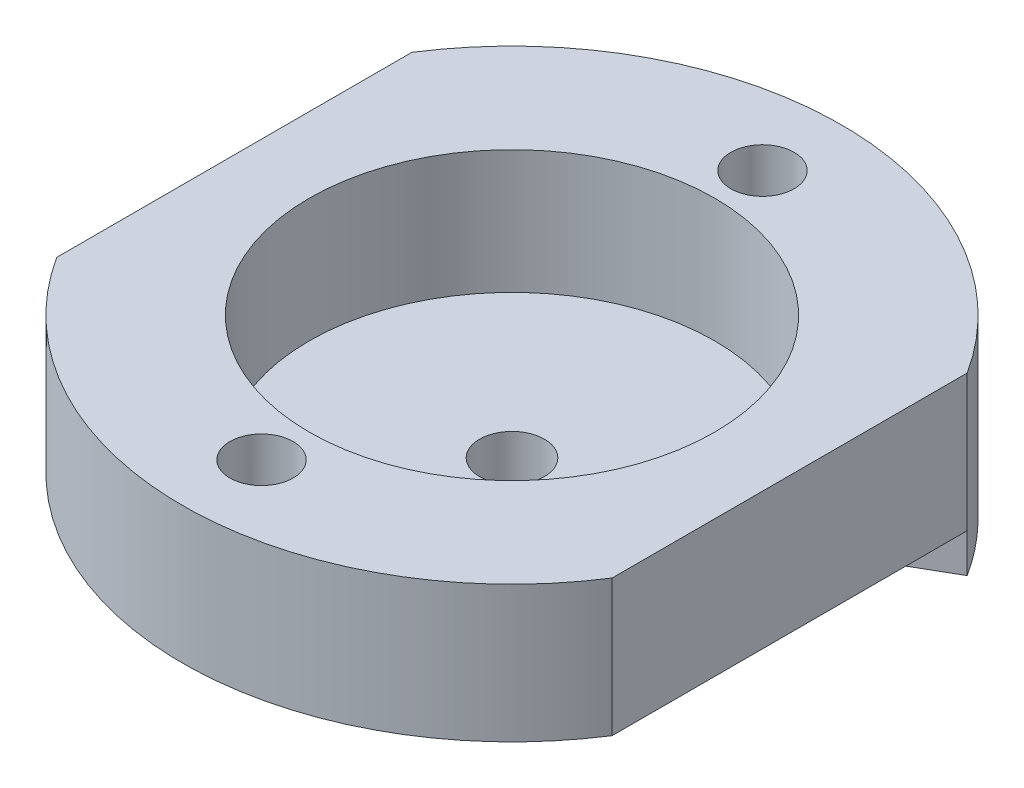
ISO-10303-21;
HEADER;
FILE_DESCRIPTION(('STEP AP214'),'2;1');
FILE_NAME('part.step','',(''),(''),'','','');
FILE_SCHEMA(('AUTOMOTIVE_DESIGN { 1 0 10303 214 1 1 1 1 }'));
ENDSEC;
DATA;
#1=APPLICATION_CONTEXT('core data for automotive mechanical design processes');
#2=APPLICATION_PROTOCOL_DEFINITION('international standard','automotive_design',2000,#1);
#3=PRODUCT_CONTEXT('',#1,'mechanical');
#4=PRODUCT('Part','Part','',(#3));
#5=PRODUCT_RELATED_PRODUCT_CATEGORY('part','',(#4));
#6=PRODUCT_DEFINITION_FORMATION('','',#4);
#7=PRODUCT_DEFINITION_CONTEXT('part definition',#1,'design');
#8=PRODUCT_DEFINITION('design','',#6,#7);
#9=PRODUCT_DEFINITION_SHAPE('','',#8);
#10=(LENGTH_UNIT() NAMED_UNIT(*) SI_UNIT(.MILLI.,.METRE.));
#11=(NAMED_UNIT(*) PLANE_ANGLE_UNIT() SI_UNIT($,.RADIAN.));
#12=(NAMED_UNIT(*) SI_UNIT($,.STERADIAN.) SOLID_ANGLE_UNIT());
#13=UNCERTAINTY_MEASURE_WITH_UNIT(LENGTH_MEASURE(1.E-05),#10,'distance_accuracy_value','');
#14=(GEOMETRIC_REPRESENTATION_CONTEXT(3) GLOBAL_UNCERTAINTY_ASSIGNED_CONTEXT((#13)) GLOBAL_UNIT_ASSIGNED_CONTEXT((#10,
#11,#12)) REPRESENTATION_CONTEXT('',''));
#15=CARTESIAN_POINT('',(0.,0.,0.));
#16=DIRECTION('',(0.,0.,1.));
#17=DIRECTION('',(1.,0.,0.));
#18=AXIS2_PLACEMENT_3D('',#15,#16,#17);
#19=CARTESIAN_POINT('',(0.,-20.3794311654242,0.));
#20=DIRECTION('',(0.,1.,0.));
#21=DIRECTION('',(0.,0.,1.));
#22=AXIS2_PLACEMENT_3D('',#19,#20,#21);
#23=CYLINDRICAL_SURFACE('',#22,5.588);
#24=CARTESIAN_POINT('',(0.,-0.5,0.));
#25=DIRECTION('',(0.,1.,0.));
#26=DIRECTION('',(0.,0.,1.));
#27=AXIS2_PLACEMENT_3D('',#24,#25,#26);
#28=CIRCLE('',#27,5.588);
#29=CARTESIAN_POINT('',(-5.37616666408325,-0.5,1.524));
#30=VERTEX_POINT('',#29);
#31=CARTESIAN_POINT('',(4.32985933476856,-0.5,-3.53243006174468));
#32=VERTEX_POINT('',#31);
#33=EDGE_CURVE('E228',#30,#32,#28,.T.);
#34=ORIENTED_EDGE('',*,*,#33,.T.);
#35=DIRECTION('',(0.,-1.,0.));
#36=VECTOR('',#35,1.);
#37=CARTESIAN_POINT('',(4.32985933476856,8.23960183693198,-3.53243006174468));
#38=LINE('',#37,#36);
#39=CARTESIAN_POINT('',(4.32985933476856,-2.,-3.53243006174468));
#40=VERTEX_POINT('',#39);
#41=EDGE_CURVE('E462',#32,#40,#38,.T.);
#42=ORIENTED_EDGE('',*,*,#41,.T.);
#43=CARTESIAN_POINT('',(0.,-2.,0.));
#44=DIRECTION('',(0.,-1.,0.));
#45=DIRECTION('',(0.,0.,-1.));
#46=AXIS2_PLACEMENT_3D('',#43,#44,#45);
#47=CIRCLE('',#46,5.588);
#48=CARTESIAN_POINT('',(-5.37616666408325,-2.,1.524));
#49=VERTEX_POINT('',#48);
#50=EDGE_CURVE('E239',#49,#40,#47,.F.);
#51=ORIENTED_EDGE('',*,*,#50,.F.);
#52=DIRECTION('',(0.,1.,0.));
#53=VECTOR('',#52,1.);
#54=CARTESIAN_POINT('',(-5.37616666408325,-20.3794311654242,1.524));
#55=LINE('',#54,#53);
#56=EDGE_CURVE('E197',#49,#30,#55,.T.);
#57=ORIENTED_EDGE('',*,*,#56,.T.);
#58=EDGE_LOOP('',(#34,#42,#51,#57));
#59=FACE_BOUND('',#58,.T.);
#60=ADVANCED_FACE('F32',(#59),#23,.F.);
#61=CARTESIAN_POINT('',(0.,-2.,0.));
#62=DIRECTION('',(0.,-1.,0.));
#63=DIRECTION('',(0.,0.,-1.));
#64=AXIS2_PLACEMENT_3D('',#61,#62,#63);
#65=PLANE('',#64);
#66=DIRECTION('',(-0.676367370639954,0.,0.736564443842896));
#67=VECTOR('',#66,1.);
#68=CARTESIAN_POINT('',(4.32985933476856,-2.,-3.53243006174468));
#69=LINE('',#68,#67);
#70=CARTESIAN_POINT('',(9.16205789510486,-2.,-8.79469698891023));
#71=VERTEX_POINT('',#70);
#72=EDGE_CURVE('E178',#71,#40,#69,.T.);
#73=ORIENTED_EDGE('',*,*,#72,.F.);
#74=CARTESIAN_POINT('',(0.,-2.,0.));
#75=DIRECTION('',(0.,-1.,0.));
#76=DIRECTION('',(0.,0.,-1.));
#77=AXIS2_PLACEMENT_3D('',#74,#75,#76);
#78=CIRCLE('',#77,12.7);
#79=CARTESIAN_POINT('',(10.7,-2.,-6.84105255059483));
#80=VERTEX_POINT('',#79);
#81=EDGE_CURVE('E195',#71,#80,#78,.T.);
#82=ORIENTED_EDGE('',*,*,#81,.T.);
#83=DIRECTION('',(-0.866025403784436,0.,0.500000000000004));
#84=VECTOR('',#83,1.);
#85=CARTESIAN_POINT('',(10.7,-2.,-6.84105255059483));
#86=LINE('',#85,#84);
#87=CARTESIAN_POINT('',(5.6310617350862,-2.,-3.91449967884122));
#88=VERTEX_POINT('',#87);
#89=EDGE_CURVE('E56',#80,#88,#86,.T.);
#90=ORIENTED_EDGE('',*,*,#89,.T.);
#91=CARTESIAN_POINT('',(0.,-2.,0.));
#92=DIRECTION('',(0.,-1.,0.));
#93=DIRECTION('',(0.,0.,-1.));
#94=AXIS2_PLACEMENT_3D('',#91,#92,#93);
#95=CIRCLE('',#94,6.858);
#96=CARTESIAN_POINT('',(-5.37616666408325,-2.,4.25781587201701));
#97=VERTEX_POINT('',#96);
#98=EDGE_CURVE('E235',#88,#97,#95,.T.);
#99=ORIENTED_EDGE('',*,*,#98,.T.);
#100=DIRECTION('',(0.,0.,-1.));
#101=VECTOR('',#100,1.);
#102=CARTESIAN_POINT('',(-5.37616666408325,-2.,1.524));
#103=LINE('',#102,#101);
#104=EDGE_CURVE('E217',#97,#49,#103,.T.);
#105=ORIENTED_EDGE('',*,*,#104,.T.);
#106=ORIENTED_EDGE('',*,*,#50,.T.);
#107=EDGE_LOOP('',(#73,#82,#90,#99,#105,#106));
#108=FACE_BOUND('',#107,.T.);
#109=ADVANCED_FACE('F390',(#108),#65,.T.);
#110=CARTESIAN_POINT('',(0.,-0.5,0.));
#111=DIRECTION('',(0.,-1.,0.));
#112=DIRECTION('',(0.,0.,-1.));
#113=AXIS2_PLACEMENT_3D('',#110,#111,#112);
#114=PLANE('',#113);
#115=DIRECTION('',(1.,0.,0.));
#116=VECTOR('',#115,1.);
#117=CARTESIAN_POINT('',(-10.7,-0.5,-1.524));
#118=LINE('',#117,#116);
#119=CARTESIAN_POINT('',(-4.35,-0.5,-1.524));
#120=VERTEX_POINT('',#119);
#121=CARTESIAN_POINT('',(-1.65527157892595,-0.5,-1.524));
#122=VERTEX_POINT('',#121);
#123=EDGE_CURVE('E258',#120,#122,#118,.T.);
#124=ORIENTED_EDGE('',*,*,#123,.F.);
#125=DIRECTION('',(0.,0.,-1.));
#126=VECTOR('',#125,1.);
#127=CARTESIAN_POINT('',(-4.35,-0.5,1.675));
#128=LINE('',#127,#126);
#129=CARTESIAN_POINT('',(-4.35,-0.5,1.524));
#130=VERTEX_POINT('',#129);
#131=EDGE_CURVE('E251',#130,#120,#128,.T.);
#132=ORIENTED_EDGE('',*,*,#131,.F.);
#133=DIRECTION('',(-1.,0.,0.));
#134=VECTOR('',#133,1.);
#135=CARTESIAN_POINT('',(-10.7,-0.5,1.524));
#136=LINE('',#135,#134);
#137=CARTESIAN_POINT('',(-1.65527157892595,-0.5,1.524));
#138=VERTEX_POINT('',#137);
#139=EDGE_CURVE('E257',#138,#130,#136,.T.);
#140=ORIENTED_EDGE('',*,*,#139,.F.);
#141=CARTESIAN_POINT('',(0.,-0.5,0.));
#142=DIRECTION('',(0.,-1.,0.));
#143=DIRECTION('',(0.,0.,-1.));
#144=AXIS2_PLACEMENT_3D('',#141,#142,#143);
#145=CIRCLE('',#144,2.25);
#146=EDGE_CURVE('E296',#122,#138,#145,.T.);
#147=ORIENTED_EDGE('',*,*,#146,.F.);
#148=EDGE_LOOP('',(#124,#132,#140,#147));
#149=FACE_BOUND('',#148,.T.);
#150=CARTESIAN_POINT('',(0.,-0.5,9.652));
#151=DIRECTION('',(0.,-1.,0.));
#152=DIRECTION('',(0.,0.,-1.));
#153=AXIS2_PLACEMENT_3D('',#150,#151,#152);
#154=CIRCLE('',#153,1.2192);
#155=CARTESIAN_POINT('',(0.,-0.5,8.4328));
#156=VERTEX_POINT('',#155);
#157=EDGE_CURVE('E290',#156,#156,#154,.T.);
#158=ORIENTED_EDGE('',*,*,#157,.F.);
#159=EDGE_LOOP('',(#158));
#160=FACE_BOUND('',#159,.T.);
#161=CARTESIAN_POINT('',(0.,-0.5,-9.652));
#162=DIRECTION('',(0.,-1.,0.));
#163=DIRECTION('',(0.,0.,-1.));
#164=AXIS2_PLACEMENT_3D('',#161,#162,#163);
#165=CIRCLE('',#164,1.2192);
#166=CARTESIAN_POINT('',(0.,-0.5,-10.8712));
#167=VERTEX_POINT('',#166);
#168=EDGE_CURVE('E284',#167,#167,#165,.T.);
#169=ORIENTED_EDGE('',*,*,#168,.F.);
#170=EDGE_LOOP('',(#169));
#171=FACE_BOUND('',#170,.T.);
#172=CARTESIAN_POINT('',(0.,-0.5,0.));
#173=DIRECTION('',(0.,-1.,0.));
#174=DIRECTION('',(0.,0.,1.));
#175=AXIS2_PLACEMENT_3D('',#172,#173,#174);
#176=CIRCLE('',#175,6.858);
#177=CARTESIAN_POINT('',(5.6310617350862,-0.5,-3.91449967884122));
#178=VERTEX_POINT('',#177);
#179=CARTESIAN_POINT('',(-5.37616666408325,-0.5,4.25781587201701));
#180=VERTEX_POINT('',#179);
#181=EDGE_CURVE('E222',#178,#180,#176,.T.);
#182=ORIENTED_EDGE('',*,*,#181,.F.);
#183=DIRECTION('',(-0.866025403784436,0.,0.500000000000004));
#184=VECTOR('',#183,1.);
#185=CARTESIAN_POINT('',(10.7,-0.5,-6.84105255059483));
#186=LINE('',#185,#184);
#187=CARTESIAN_POINT('',(10.7,-0.5,-6.84105255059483));
#188=VERTEX_POINT('',#187);
#189=EDGE_CURVE('E205',#188,#178,#186,.T.);
#190=ORIENTED_EDGE('',*,*,#189,.F.);
#191=DIRECTION('',(0.,0.,-1.));
#192=VECTOR('',#191,1.);
#193=CARTESIAN_POINT('',(10.7,-0.5,0.));
#194=LINE('',#193,#192);
#195=CARTESIAN_POINT('',(10.7,-0.5,6.84105255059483));
#196=VERTEX_POINT('',#195);
#197=EDGE_CURVE('E273',#196,#188,#194,.T.);
#198=ORIENTED_EDGE('',*,*,#197,.F.);
#199=CARTESIAN_POINT('',(0.,-0.5,0.));
#200=DIRECTION('',(0.,-1.,0.));
#201=DIRECTION('',(0.,0.,-1.));
#202=AXIS2_PLACEMENT_3D('',#199,#200,#201);
#203=CIRCLE('',#202,12.7);
#204=CARTESIAN_POINT('',(-10.7,-0.5,6.84105255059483));
#205=VERTEX_POINT('',#204);
#206=EDGE_CURVE('E302',#196,#205,#203,.T.);
#207=ORIENTED_EDGE('',*,*,#206,.T.);
#208=DIRECTION('',(0.,0.,1.));
#209=VECTOR('',#208,1.);
#210=CARTESIAN_POINT('',(-10.7,-0.5,0.));
#211=LINE('',#210,#209);
#212=CARTESIAN_POINT('',(-10.7,-0.5,-6.84105255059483));
#213=VERTEX_POINT('',#212);
#214=EDGE_CURVE('E279',#213,#205,#211,.T.);
#215=ORIENTED_EDGE('',*,*,#214,.F.);
#216=CARTESIAN_POINT('',(5.90618106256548,-0.5,-11.2430878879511));
#217=VERTEX_POINT('',#216);
#218=EDGE_CURVE('E303',#213,#217,#203,.T.);
#219=ORIENTED_EDGE('',*,*,#218,.T.);
#220=DIRECTION('',(0.424528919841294,0.,-0.905414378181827));
#221=VECTOR('',#220,1.);
#222=CARTESIAN_POINT('',(3.42136840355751,-0.5,-5.94360179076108));
#223=LINE('',#222,#221);
#224=CARTESIAN_POINT('',(3.42136840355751,-0.5,-5.94360179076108));
#225=VERTEX_POINT('',#224);
#226=EDGE_CURVE('E202',#225,#217,#223,.T.);
#227=ORIENTED_EDGE('',*,*,#226,.F.);
#228=CARTESIAN_POINT('',(-5.37616666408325,-0.5,-4.25781587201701));
#229=VERTEX_POINT('',#228);
#230=EDGE_CURVE('E219',#229,#225,#176,.T.);
#231=ORIENTED_EDGE('',*,*,#230,.F.);
#232=DIRECTION('',(0.,0.,-1.));
#233=VECTOR('',#232,1.);
#234=CARTESIAN_POINT('',(-5.37616666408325,-0.5,-1.524));
#235=LINE('',#234,#233);
#236=CARTESIAN_POINT('',(-5.37616666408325,-0.5,-1.524));
#237=VERTEX_POINT('',#236);
#238=EDGE_CURVE('E223',#237,#229,#235,.T.);
#239=ORIENTED_EDGE('',*,*,#238,.F.);
#240=CARTESIAN_POINT('',(3.15135622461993,-0.5,-4.61461785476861));
#241=VERTEX_POINT('',#240);
#242=EDGE_CURVE('E231',#241,#237,#28,.T.);
#243=ORIENTED_EDGE('',*,*,#242,.F.);
#244=DIRECTION('',(-0.676367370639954,0.,0.736564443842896));
#245=VECTOR('',#244,1.);
#246=CARTESIAN_POINT('',(3.15135622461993,-0.5,-4.61461785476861));
#247=LINE('',#246,#245);
#248=CARTESIAN_POINT('',(7.98355478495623,-0.5,-9.87688478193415));
#249=VERTEX_POINT('',#248);
#250=EDGE_CURVE('E213',#249,#241,#247,.T.);
#251=ORIENTED_EDGE('',*,*,#250,.F.);
#252=CARTESIAN_POINT('',(0.,-0.5,0.));
#253=DIRECTION('',(0.,-1.,0.));
#254=DIRECTION('',(0.,0.,-1.));
#255=AXIS2_PLACEMENT_3D('',#252,#253,#254);
#256=CIRCLE('',#255,12.7);
#257=CARTESIAN_POINT('',(9.16205789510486,-0.5,-8.79469698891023));
#258=VERTEX_POINT('',#257);
#259=EDGE_CURVE('E189',#258,#249,#256,.F.);
#260=ORIENTED_EDGE('',*,*,#259,.F.);
#261=DIRECTION('',(0.676367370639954,0.,-0.736564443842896));
#262=VECTOR('',#261,1.);
#263=CARTESIAN_POINT('',(4.32985933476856,-0.5,-3.53243006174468));
#264=LINE('',#263,#262);
#265=EDGE_CURVE('E465',#32,#258,#264,.T.);
#266=ORIENTED_EDGE('',*,*,#265,.F.);
#267=ORIENTED_EDGE('',*,*,#33,.F.);
#268=DIRECTION('',(0.,0.,-1.));
#269=VECTOR('',#268,1.);
#270=CARTESIAN_POINT('',(-5.37616666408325,-0.5,1.524));
#271=LINE('',#270,#269);
#272=EDGE_CURVE('E214',#180,#30,#271,.T.);
#273=ORIENTED_EDGE('',*,*,#272,.F.);
#274=EDGE_LOOP('',(#182,#190,#198,#207,#215,#219,#227,#231,#239,#243,#251,#260,#266,#267,#273));
#275=FACE_BOUND('',#274,.T.);
#276=ADVANCED_FACE('F386',(#149,#160,#171,#275),#114,.T.);
#277=CARTESIAN_POINT('',(0.,-20.3794311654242,0.));
#278=DIRECTION('',(0.,1.,0.));
#279=DIRECTION('',(0.,0.,1.));
#280=AXIS2_PLACEMENT_3D('',#277,#278,#279);
#281=CYLINDRICAL_SURFACE('',#280,6.858);
#282=DIRECTION('',(0.,1.,0.));
#283=VECTOR('',#282,1.);
#284=CARTESIAN_POINT('',(5.6310617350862,-12.3289245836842,-3.91449967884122));
#285=LINE('',#284,#283);
#286=EDGE_CURVE('E207',#88,#178,#285,.T.);
#287=ORIENTED_EDGE('',*,*,#286,.T.);
#288=ORIENTED_EDGE('',*,*,#181,.T.);
#289=DIRECTION('',(0.,1.,0.));
#290=VECTOR('',#289,1.);
#291=CARTESIAN_POINT('',(-5.37616666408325,-20.3794311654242,4.25781587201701));
#292=LINE('',#291,#290);
#293=EDGE_CURVE('E218',#97,#180,#292,.T.);
#294=ORIENTED_EDGE('',*,*,#293,.F.);
#295=ORIENTED_EDGE('',*,*,#98,.F.);
#296=EDGE_LOOP('',(#287,#288,#294,#295));
#297=FACE_BOUND('',#296,.T.);
#298=ADVANCED_FACE('F389',(#297),#281,.T.);
#299=DIRECTION('',(0.,1.,0.));
#300=VECTOR('',#299,1.);
#301=CARTESIAN_POINT('',(3.42136840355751,-12.3289245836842,-5.94360179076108));
#302=LINE('',#301,#300);
#303=CARTESIAN_POINT('',(3.42136840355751,-2.,-5.94360179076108));
#304=VERTEX_POINT('',#303);
#305=EDGE_CURVE('E210',#304,#225,#302,.T.);
#306=ORIENTED_EDGE('',*,*,#305,.F.);
#307=CARTESIAN_POINT('',(-5.37616666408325,-2.,-4.25781587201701));
#308=VERTEX_POINT('',#307);
#309=EDGE_CURVE('E232',#308,#304,#95,.T.);
#310=ORIENTED_EDGE('',*,*,#309,.F.);
#311=DIRECTION('',(0.,1.,0.));
#312=VECTOR('',#311,1.);
#313=CARTESIAN_POINT('',(-5.37616666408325,-20.3794311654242,-4.25781587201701));
#314=LINE('',#313,#312);
#315=EDGE_CURVE('E226',#308,#229,#314,.T.);
#316=ORIENTED_EDGE('',*,*,#315,.T.);
#317=ORIENTED_EDGE('',*,*,#230,.T.);
#318=EDGE_LOOP('',(#306,#310,#316,#317));
#319=FACE_BOUND('',#318,.T.);
#320=ADVANCED_FACE('F365',(#319),#281,.T.);
#321=CARTESIAN_POINT('',(-10.7,-2.,-6.84105255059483));
#322=DIRECTION('',(1.,0.,0.));
#323=DIRECTION('',(0.,0.,-1.));
#324=AXIS2_PLACEMENT_3D('',#321,#322,#323);
#325=PLANE('',#324);
#326=ORIENTED_EDGE('',*,*,#214,.T.);
#327=DIRECTION('',(0.,-1.,0.));
#328=VECTOR('',#327,1.);
#329=CARTESIAN_POINT('',(-10.7,4.762500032,6.84105255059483));
#330=LINE('',#329,#328);
#331=CARTESIAN_POINT('',(-10.7,4.762500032,6.84105255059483));
#332=VERTEX_POINT('',#331);
#333=EDGE_CURVE('E325',#332,#205,#330,.T.);
#334=ORIENTED_EDGE('',*,*,#333,.F.);
#335=DIRECTION('',(0.,0.,-1.));
#336=VECTOR('',#335,1.);
#337=CARTESIAN_POINT('',(-10.7,4.762500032,-6.84105255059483));
#338=LINE('',#337,#336);
#339=CARTESIAN_POINT('',(-10.7,4.762500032,-6.84105255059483));
#340=VERTEX_POINT('',#339);
#341=EDGE_CURVE('E276',#332,#340,#338,.T.);
#342=ORIENTED_EDGE('',*,*,#341,.T.);
#343=DIRECTION('',(0.,-1.,0.));
#344=VECTOR('',#343,1.);
#345=CARTESIAN_POINT('',(-10.7,4.762500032,-6.84105255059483));
#346=LINE('',#345,#344);
#347=EDGE_CURVE('E322',#213,#340,#346,.F.);
#348=ORIENTED_EDGE('',*,*,#347,.F.);
#349=EDGE_LOOP('',(#326,#334,#342,#348));
#350=FACE_BOUND('',#349,.T.);
#351=ADVANCED_FACE('F361',(#350),#325,.F.);
#352=CARTESIAN_POINT('',(0.,-2.,0.));
#353=DIRECTION('',(0.,1.,0.));
#354=DIRECTION('',(0.,0.,1.));
#355=AXIS2_PLACEMENT_3D('',#352,#353,#354);
#356=CYLINDRICAL_SURFACE('',#355,2.25);
#357=DIRECTION('',(0.,1.,0.));
#358=VECTOR('',#357,1.);
#359=CARTESIAN_POINT('',(-1.65527157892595,-2.,1.524));
#360=LINE('',#359,#358);
#361=CARTESIAN_POINT('',(-1.65527157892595,-1.5,1.524));
#362=VERTEX_POINT('',#361);
#363=EDGE_CURVE('E269',#362,#138,#360,.T.);
#364=ORIENTED_EDGE('',*,*,#363,.F.);
#365=CARTESIAN_POINT('',(0.,-1.5,0.));
#366=DIRECTION('',(0.,-1.,0.));
#367=DIRECTION('',(0.,0.,-1.));
#368=AXIS2_PLACEMENT_3D('',#365,#366,#367);
#369=CIRCLE('',#368,2.25);
#370=CARTESIAN_POINT('',(-1.65527157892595,-1.5,-1.524));
#371=VERTEX_POINT('',#370);
#372=EDGE_CURVE('E319',#362,#371,#369,.F.);
#373=ORIENTED_EDGE('',*,*,#372,.T.);
#374=DIRECTION('',(0.,1.,0.));
#375=VECTOR('',#374,1.);
#376=CARTESIAN_POINT('',(-1.65527157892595,-2.,-1.524));
#377=LINE('',#376,#375);
#378=EDGE_CURVE('E266',#122,#371,#377,.F.);
#379=ORIENTED_EDGE('',*,*,#378,.F.);
#380=ORIENTED_EDGE('',*,*,#146,.T.);
#381=EDGE_LOOP('',(#364,#373,#379,#380));
#382=FACE_BOUND('',#381,.T.);
#383=ADVANCED_FACE('F364',(#382),#356,.T.);
#384=CARTESIAN_POINT('',(0.,-2.,0.));
#385=DIRECTION('',(0.,1.,0.));
#386=DIRECTION('',(0.,0.,1.));
#387=AXIS2_PLACEMENT_3D('',#384,#385,#386);
#388=CONICAL_SURFACE('',#387,1.75000000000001,0.785398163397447);
#389=ORIENTED_EDGE('',*,*,#372,.F.);
#390=CARTESIAN_POINT('',(-2.74125689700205,-0.613590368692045,1.524));
#391=CARTESIAN_POINT('',(-2.64453424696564,-0.698066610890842,1.524));
#392=CARTESIAN_POINT('',(-2.54733540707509,-0.782017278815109,1.524));
#393=CARTESIAN_POINT('',(-2.35146561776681,-0.948359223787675,1.524));
#394=CARTESIAN_POINT('',(-2.25279343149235,-1.03074904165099,1.524));
#395=CARTESIAN_POINT('',(-2.05217625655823,-1.19449334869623,1.524));
#396=CARTESIAN_POINT('',(-1.9502045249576,-1.27581522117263,1.524));
#397=CARTESIAN_POINT('',(-1.74370608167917,-1.43510557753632,1.524));
#398=CARTESIAN_POINT('',(-1.63918036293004,-1.51307533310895,1.524));
#399=CARTESIAN_POINT('',(-1.47014024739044,-1.63293752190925,1.524));
#400=CARTESIAN_POINT('',(-1.40681499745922,-1.67650090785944,1.524));
#401=CARTESIAN_POINT('',(-1.27860522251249,-1.7612600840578,1.524));
#402=CARTESIAN_POINT('',(-1.21372095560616,-1.80245626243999,1.524));
#403=CARTESIAN_POINT('',(-1.08212329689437,-1.88162906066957,1.524));
#404=CARTESIAN_POINT('',(-1.01541280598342,-1.91961043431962,1.524));
#405=CARTESIAN_POINT('',(-0.879746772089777,-1.9912484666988,1.524));
#406=CARTESIAN_POINT('',(-0.810792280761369,-2.02490711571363,1.524));
#407=CARTESIAN_POINT('',(-0.64524263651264,-2.09724600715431,1.524));
#408=CARTESIAN_POINT('',(-0.547508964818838,-2.13348133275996,1.524));
#409=CARTESIAN_POINT('',(-0.397710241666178,-2.17568492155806,1.524));
#410=CARTESIAN_POINT('',(-0.347346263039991,-2.18771610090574,1.524));
#411=CARTESIAN_POINT('',(-0.24574083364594,-2.20711783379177,1.524));
#412=CARTESIAN_POINT('',(-0.19450012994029,-2.21449217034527,1.524));
#413=CARTESIAN_POINT('',(-0.114936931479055,-2.22192867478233,1.524));
#414=CARTESIAN_POINT('',(-0.0867739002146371,-2.22379067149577,1.524));
#415=CARTESIAN_POINT('',(-0.030330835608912,-2.22596056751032,1.524));
#416=CARTESIAN_POINT('',(-0.002050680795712,-2.22626529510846,1.524));
#417=CARTESIAN_POINT('',(0.0262212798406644,-2.22577444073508,1.524));
#418=B_SPLINE_CURVE_WITH_KNOTS('',3,(#390,#391,#392,#393,#394,#395,#396,#397,#398,#399,#400,
#401,#402,#403,#404,#405,#406,#407,#408,#409,#410,#411,#412,#413,#414,#415,#416,#417),
.UNSPECIFIED.,.F.,.F.,(4,2,2,2,2,2,2,2,2,2,2,2,2,4),(0.,0.385275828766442,0.770895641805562,
1.16213863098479,1.55323186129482,1.78378012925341,2.0142904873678,2.24445380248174,
2.47451076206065,2.78606404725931,2.9412327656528,3.09627526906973,3.18091008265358,
3.26571720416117),.UNSPECIFIED.);
#419=CARTESIAN_POINT('',(-0.860188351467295,-2.,1.524));
#420=VERTEX_POINT('',#419);
#421=EDGE_CURVE('E41',#362,#420,#418,.T.);
#422=ORIENTED_EDGE('',*,*,#421,.T.);
#423=CARTESIAN_POINT('',(0.,-2.,0.));
#424=DIRECTION('',(0.,-1.,0.));
#425=DIRECTION('',(0.,0.,-1.));
#426=AXIS2_PLACEMENT_3D('',#423,#424,#425);
#427=CIRCLE('',#426,1.75000000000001);
#428=CARTESIAN_POINT('',(-0.860188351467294,-2.,-1.524));
#429=VERTEX_POINT('',#428);
#430=EDGE_CURVE('E316',#429,#420,#427,.T.);
#431=ORIENTED_EDGE('',*,*,#430,.F.);
#432=CARTESIAN_POINT('',(0.026221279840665,-2.22577444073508,-1.524));
#433=CARTESIAN_POINT('',(-0.0118177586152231,-2.2264475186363,-1.524));
#434=CARTESIAN_POINT('',(-0.0498745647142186,-2.22566052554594,-1.524));
#435=CARTESIAN_POINT('',(-0.125788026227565,-2.22128177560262,-1.524));
#436=CARTESIAN_POINT('',(-0.163644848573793,-2.21769293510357,-1.524));
#437=CARTESIAN_POINT('',(-0.238408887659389,-2.20790452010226,-1.524));
#438=CARTESIAN_POINT('',(-0.275321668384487,-2.20174697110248,-1.524));
#439=CARTESIAN_POINT('',(-0.348671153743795,-2.18703605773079,-1.524));
#440=CARTESIAN_POINT('',(-0.385107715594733,-2.17848199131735,-1.524));
#441=CARTESIAN_POINT('',(-0.488101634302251,-2.15104089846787,-1.524));
#442=CARTESIAN_POINT('',(-0.553969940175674,-2.12954671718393,-1.524));
#443=CARTESIAN_POINT('',(-0.683547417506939,-2.08080996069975,-1.524));
#444=CARTESIAN_POINT('',(-0.747254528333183,-2.05356206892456,-1.524));
#445=CARTESIAN_POINT('',(-0.87378881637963,-1.9941800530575,-1.524));
#446=CARTESIAN_POINT('',(-0.936576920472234,-1.96196368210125,-1.524));
#447=CARTESIAN_POINT('',(-1.06026481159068,-1.89418109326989,-1.524));
#448=CARTESIAN_POINT('',(-1.12116528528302,-1.85861611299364,-1.524));
#449=CARTESIAN_POINT('',(-1.25379848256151,-1.77736272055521,-1.524));
#450=CARTESIAN_POINT('',(-1.32517637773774,-1.73109872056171,-1.524));
#451=CARTESIAN_POINT('',(-1.46613525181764,-1.63589697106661,-1.524));
#452=CARTESIAN_POINT('',(-1.53571577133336,-1.58695854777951,-1.524));
#453=CARTESIAN_POINT('',(-1.67352760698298,-1.48703342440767,-1.524));
#454=CARTESIAN_POINT('',(-1.74175696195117,-1.43604403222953,-1.524));
#455=CARTESIAN_POINT('',(-1.87706174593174,-1.33255524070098,-1.524));
#456=CARTESIAN_POINT('',(-1.94413711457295,-1.2800557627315,-1.524));
#457=CARTESIAN_POINT('',(-2.07302042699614,-1.17734058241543,-1.524));
#458=CARTESIAN_POINT('',(-2.1348871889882,-1.12719846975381,-1.524));
#459=CARTESIAN_POINT('',(-2.25794769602,-1.02609204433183,-1.524));
#460=CARTESIAN_POINT('',(-2.31914141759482,-0.975127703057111,-1.524));
#461=CARTESIAN_POINT('',(-2.44075855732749,-0.872708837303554,-1.524));
#462=CARTESIAN_POINT('',(-2.50118389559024,-0.821256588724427,-1.524));
#463=CARTESIAN_POINT('',(-2.6215563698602,-0.717806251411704,-1.524));
#464=CARTESIAN_POINT('',(-2.6815035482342,-0.665808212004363,-1.524));
#465=CARTESIAN_POINT('',(-2.74125689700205,-0.613590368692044,-1.524));
#466=B_SPLINE_CURVE_WITH_KNOTS('',3,(#432,#433,#434,#435,#436,#437,#438,#439,#440,#441,#442,
#443,#444,#445,#446,#447,#448,#449,#450,#451,#452,#453,#454,#455,#456,#457,#458,#459,#460,#461,
#462,#463,#464,#465),.UNSPECIFIED.,.F.,.F.,(4,2,2,2,2,2,2,2,2,2,2,2,2,2,2,2,4),(0.,
0.114095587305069,0.228072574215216,0.340253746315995,0.452467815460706,0.659944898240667,
0.867614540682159,1.07918924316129,1.29068605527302,1.54577936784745,1.80093724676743,
2.05644173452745,2.31195954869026,2.55085606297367,2.78976087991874,3.02784768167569,
3.26591314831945),.UNSPECIFIED.);
#467=EDGE_CURVE('E334',#429,#371,#466,.T.);
#468=ORIENTED_EDGE('',*,*,#467,.T.);
#469=EDGE_LOOP('',(#389,#422,#431,#468));
#470=FACE_BOUND('',#469,.T.);
#471=ADVANCED_FACE('F34',(#470),#388,.T.);
#472=CARTESIAN_POINT('',(0.,4.762500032,0.));
#473=DIRECTION('',(0.,-1.,0.));
#474=DIRECTION('',(0.,0.,-1.));
#475=AXIS2_PLACEMENT_3D('',#472,#473,#474);
#476=CYLINDRICAL_SURFACE('',#475,12.7);
#477=ORIENTED_EDGE('',*,*,#81,.F.);
#478=DIRECTION('',(0.,-1.,0.));
#479=VECTOR('',#478,1.);
#480=CARTESIAN_POINT('',(9.16205789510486,8.23960183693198,-8.79469698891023));
#481=LINE('',#480,#479);
#482=EDGE_CURVE('E190',#258,#71,#481,.T.);
#483=ORIENTED_EDGE('',*,*,#482,.F.);
#484=ORIENTED_EDGE('',*,*,#259,.T.);
#485=DIRECTION('',(0.,-1.,0.));
#486=VECTOR('',#485,1.);
#487=CARTESIAN_POINT('',(7.98355478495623,8.23960183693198,-9.87688478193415));
#488=LINE('',#487,#486);
#489=CARTESIAN_POINT('',(7.98355478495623,-2.,-9.87688478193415));
#490=VERTEX_POINT('',#489);
#491=EDGE_CURVE('E173',#249,#490,#488,.T.);
#492=ORIENTED_EDGE('',*,*,#491,.T.);
#493=CARTESIAN_POINT('',(5.90618106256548,-2.,-11.2430878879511));
#494=VERTEX_POINT('',#493);
#495=EDGE_CURVE('E185',#494,#490,#78,.T.);
#496=ORIENTED_EDGE('',*,*,#495,.F.);
#497=DIRECTION('',(0.,1.,0.));
#498=VECTOR('',#497,1.);
#499=CARTESIAN_POINT('',(5.90618106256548,-12.3289245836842,-11.2430878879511));
#500=LINE('',#499,#498);
#501=EDGE_CURVE('E206',#494,#217,#500,.T.);
#502=ORIENTED_EDGE('',*,*,#501,.T.);
#503=ORIENTED_EDGE('',*,*,#218,.F.);
#504=ORIENTED_EDGE('',*,*,#347,.T.);
#505=CARTESIAN_POINT('',(0.,4.762500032,0.));
#506=DIRECTION('',(0.,1.,0.));
#507=DIRECTION('',(0.,0.,1.));
#508=AXIS2_PLACEMENT_3D('',#505,#506,#507);
#509=CIRCLE('',#508,12.7);
#510=CARTESIAN_POINT('',(10.7,4.762500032,-6.84105255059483));
#511=VERTEX_POINT('',#510);
#512=EDGE_CURVE('E310',#511,#340,#509,.T.);
#513=ORIENTED_EDGE('',*,*,#512,.F.);
#514=DIRECTION('',(0.,-1.,0.));
#515=VECTOR('',#514,1.);
#516=CARTESIAN_POINT('',(10.7,4.762500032,-6.84105255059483));
#517=LINE('',#516,#515);
#518=EDGE_CURVE('E331',#511,#188,#517,.T.);
#519=ORIENTED_EDGE('',*,*,#518,.T.);
#520=DIRECTION('',(0.,1.,0.));
#521=VECTOR('',#520,1.);
#522=CARTESIAN_POINT('',(10.7,-12.3289245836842,-6.84105255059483));
#523=LINE('',#522,#521);
#524=EDGE_CURVE('E203',#80,#188,#523,.T.);
#525=ORIENTED_EDGE('',*,*,#524,.F.);
#526=EDGE_LOOP('',(#477,#483,#484,#492,#496,#502,#503,#504,#513,#519,#525));
#527=FACE_BOUND('',#526,.T.);
#528=ADVANCED_FACE('F184',(#527),#476,.T.);
#529=CARTESIAN_POINT('',(0.,4.762500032,0.));
#530=DIRECTION('',(0.,1.,0.));
#531=DIRECTION('',(0.,0.,1.));
#532=AXIS2_PLACEMENT_3D('',#529,#530,#531);
#533=PLANE('',#532);
#534=DIRECTION('',(0.,0.,1.));
#535=VECTOR('',#534,1.);
#536=CARTESIAN_POINT('',(10.7,4.762500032,6.84105255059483));
#537=LINE('',#536,#535);
#538=CARTESIAN_POINT('',(10.7,4.762500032,6.84105255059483));
#539=VERTEX_POINT('',#538);
#540=EDGE_CURVE('E271',#511,#539,#537,.T.);
#541=ORIENTED_EDGE('',*,*,#540,.F.);
#542=ORIENTED_EDGE('',*,*,#512,.T.);
#543=ORIENTED_EDGE('',*,*,#341,.F.);
#544=EDGE_CURVE('E313',#332,#539,#509,.T.);
#545=ORIENTED_EDGE('',*,*,#544,.T.);
#546=EDGE_LOOP('',(#541,#542,#543,#545));
#547=FACE_BOUND('',#546,.T.);
#548=CARTESIAN_POINT('',(0.,4.762500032,-9.652));
#549=DIRECTION('',(0.,1.,0.));
#550=DIRECTION('',(0.,0.,1.));
#551=AXIS2_PLACEMENT_3D('',#548,#549,#550);
#552=CIRCLE('',#551,1.2192);
#553=CARTESIAN_POINT('',(0.,4.762500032,-8.4328));
#554=VERTEX_POINT('',#553);
#555=EDGE_CURVE('E281',#554,#554,#552,.T.);
#556=ORIENTED_EDGE('',*,*,#555,.F.);
#557=EDGE_LOOP('',(#556));
#558=FACE_BOUND('',#557,.T.);
#559=CARTESIAN_POINT('',(0.,4.762500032,9.652));
#560=DIRECTION('',(0.,1.,0.));
#561=DIRECTION('',(0.,0.,1.));
#562=AXIS2_PLACEMENT_3D('',#559,#560,#561);
#563=CIRCLE('',#562,1.2192);
#564=CARTESIAN_POINT('',(0.,4.762500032,10.8712));
#565=VERTEX_POINT('',#564);
#566=EDGE_CURVE('E287',#565,#565,#563,.T.);
#567=ORIENTED_EDGE('',*,*,#566,.F.);
#568=EDGE_LOOP('',(#567));
#569=FACE_BOUND('',#568,.T.);
#570=CARTESIAN_POINT('',(0.,4.762500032,0.));
#571=DIRECTION('',(0.,1.,0.));
#572=DIRECTION('',(0.,0.,1.));
#573=AXIS2_PLACEMENT_3D('',#570,#571,#572);
#574=CIRCLE('',#573,7.8105);
#575=CARTESIAN_POINT('',(0.,4.762500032,7.8105));
#576=VERTEX_POINT('',#575);
#577=EDGE_CURVE('E307',#576,#576,#574,.T.);
#578=ORIENTED_EDGE('',*,*,#577,.F.);
#579=EDGE_LOOP('',(#578));
#580=FACE_BOUND('',#579,.T.);
#581=ADVANCED_FACE('F400',(#547,#558,#569,#580),#533,.T.);
#582=ORIENTED_EDGE('',*,*,#206,.F.);
#583=DIRECTION('',(0.,-1.,0.));
#584=VECTOR('',#583,1.);
#585=CARTESIAN_POINT('',(10.7,4.762500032,6.84105255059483));
#586=LINE('',#585,#584);
#587=EDGE_CURVE('E328',#196,#539,#586,.F.);
#588=ORIENTED_EDGE('',*,*,#587,.T.);
#589=ORIENTED_EDGE('',*,*,#544,.F.);
#590=ORIENTED_EDGE('',*,*,#333,.T.);
#591=EDGE_LOOP('',(#582,#588,#589,#590));
#592=FACE_BOUND('',#591,.T.);
#593=ADVANCED_FACE('F398',(#592),#476,.T.);
#594=CARTESIAN_POINT('',(0.,4.762500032,0.));
#595=DIRECTION('',(0.,-1.,0.));
#596=DIRECTION('',(0.,0.,-1.));
#597=AXIS2_PLACEMENT_3D('',#594,#595,#596);
#598=CYLINDRICAL_SURFACE('',#597,7.8105);
#599=ORIENTED_EDGE('',*,*,#577,.T.);
#600=EDGE_LOOP('',(#599));
#601=FACE_BOUND('',#600,.T.);
#602=CARTESIAN_POINT('',(0.,0.,0.));
#603=DIRECTION('',(0.,1.,0.));
#604=DIRECTION('',(0.,0.,1.));
#605=AXIS2_PLACEMENT_3D('',#602,#603,#604);
#606=CIRCLE('',#605,7.8105);
#607=CARTESIAN_POINT('',(0.,0.,7.8105));
#608=VERTEX_POINT('',#607);
#609=EDGE_CURVE('E306',#608,#608,#606,.T.);
#610=ORIENTED_EDGE('',*,*,#609,.F.);
#611=EDGE_LOOP('',(#610));
#612=FACE_BOUND('',#611,.T.);
#613=ADVANCED_FACE('F394',(#601,#612),#598,.F.);
#614=CARTESIAN_POINT('',(0.,0.,0.));
#615=DIRECTION('',(0.,-1.,0.));
#616=DIRECTION('',(0.,0.,-1.));
#617=AXIS2_PLACEMENT_3D('',#614,#615,#616);
#618=PLANE('',#617);
#619=CARTESIAN_POINT('',(0.,0.,0.));
#620=DIRECTION('',(0.,-1.,0.));
#621=DIRECTION('',(0.,0.,-1.));
#622=AXIS2_PLACEMENT_3D('',#619,#620,#621);
#623=CIRCLE('',#622,1.25);
#624=CARTESIAN_POINT('',(0.,0.,-1.25));
#625=VERTEX_POINT('',#624);
#626=EDGE_CURVE('E299',#625,#625,#623,.T.);
#627=ORIENTED_EDGE('',*,*,#626,.T.);
#628=EDGE_LOOP('',(#627));
#629=FACE_BOUND('',#628,.T.);
#630=ORIENTED_EDGE('',*,*,#609,.T.);
#631=EDGE_LOOP('',(#630));
#632=FACE_BOUND('',#631,.T.);
#633=ADVANCED_FACE('F384',(#629,#632),#618,.F.);
#634=CARTESIAN_POINT('',(0.,4.762500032,0.));
#635=DIRECTION('',(0.,-1.,0.));
#636=DIRECTION('',(0.,0.,-1.));
#637=AXIS2_PLACEMENT_3D('',#634,#635,#636);
#638=CYLINDRICAL_SURFACE('',#637,1.25);
#639=ORIENTED_EDGE('',*,*,#626,.F.);
#640=EDGE_LOOP('',(#639));
#641=FACE_BOUND('',#640,.T.);
#642=CARTESIAN_POINT('',(0.,-2.,0.));
#643=DIRECTION('',(0.,-1.,0.));
#644=DIRECTION('',(0.,0.,-1.));
#645=AXIS2_PLACEMENT_3D('',#642,#643,#644);
#646=CIRCLE('',#645,1.25);
#647=CARTESIAN_POINT('',(0.,-2.,-1.25));
#648=VERTEX_POINT('',#647);
#649=EDGE_CURVE('E293',#648,#648,#646,.T.);
#650=ORIENTED_EDGE('',*,*,#649,.T.);
#651=EDGE_LOOP('',(#650));
#652=FACE_BOUND('',#651,.T.);
#653=ADVANCED_FACE('F377',(#641,#652),#638,.F.);
#654=CARTESIAN_POINT('',(0.,-2.,0.));
#655=DIRECTION('',(0.,-1.,0.));
#656=DIRECTION('',(0.,0.,-1.));
#657=AXIS2_PLACEMENT_3D('',#654,#655,#656);
#658=PLANE('',#657);
#659=DIRECTION('',(0.,0.,1.));
#660=VECTOR('',#659,1.);
#661=CARTESIAN_POINT('',(-4.35,-2.,1.675));
#662=LINE('',#661,#660);
#663=CARTESIAN_POINT('',(-4.35,-2.,-1.524));
#664=VERTEX_POINT('',#663);
#665=CARTESIAN_POINT('',(-4.35,-2.,1.524));
#666=VERTEX_POINT('',#665);
#667=EDGE_CURVE('E234',#664,#666,#662,.T.);
#668=ORIENTED_EDGE('',*,*,#667,.F.);
#669=DIRECTION('',(1.,0.,0.));
#670=VECTOR('',#669,1.);
#671=CARTESIAN_POINT('',(-10.7,-2.,-1.524));
#672=LINE('',#671,#670);
#673=EDGE_CURVE('E260',#664,#429,#672,.T.);
#674=ORIENTED_EDGE('',*,*,#673,.T.);
#675=ORIENTED_EDGE('',*,*,#430,.T.);
#676=DIRECTION('',(-1.,0.,0.));
#677=VECTOR('',#676,1.);
#678=CARTESIAN_POINT('',(-10.7,-2.,1.524));
#679=LINE('',#678,#677);
#680=EDGE_CURVE('E263',#420,#666,#679,.T.);
#681=ORIENTED_EDGE('',*,*,#680,.T.);
#682=EDGE_LOOP('',(#668,#674,#675,#681));
#683=FACE_BOUND('',#682,.T.);
#684=ORIENTED_EDGE('',*,*,#649,.F.);
#685=EDGE_LOOP('',(#684));
#686=FACE_BOUND('',#685,.T.);
#687=ADVANCED_FACE('F373',(#683,#686),#658,.T.);
#688=CARTESIAN_POINT('',(0.,4.762500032,9.652));
#689=DIRECTION('',(0.,1.,0.));
#690=DIRECTION('',(0.,0.,1.));
#691=AXIS2_PLACEMENT_3D('',#688,#689,#690);
#692=CYLINDRICAL_SURFACE('',#691,1.2192);
#693=ORIENTED_EDGE('',*,*,#157,.T.);
#694=EDGE_LOOP('',(#693));
#695=FACE_BOUND('',#694,.T.);
#696=ORIENTED_EDGE('',*,*,#566,.T.);
#697=EDGE_LOOP('',(#696));
#698=FACE_BOUND('',#697,.T.);
#699=ADVANCED_FACE('F369',(#695,#698),#692,.F.);
#700=CARTESIAN_POINT('',(0.,4.762500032,-9.652));
#701=DIRECTION('',(0.,1.,0.));
#702=DIRECTION('',(0.,0.,1.));
#703=AXIS2_PLACEMENT_3D('',#700,#701,#702);
#704=CYLINDRICAL_SURFACE('',#703,1.2192);
#705=ORIENTED_EDGE('',*,*,#168,.T.);
#706=EDGE_LOOP('',(#705));
#707=FACE_BOUND('',#706,.T.);
#708=ORIENTED_EDGE('',*,*,#555,.T.);
#709=EDGE_LOOP('',(#708));
#710=FACE_BOUND('',#709,.T.);
#711=ADVANCED_FACE('F359',(#707,#710),#704,.F.);
#712=CARTESIAN_POINT('',(10.7,-2.,6.84105255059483));
#713=DIRECTION('',(-1.,0.,0.));
#714=DIRECTION('',(0.,0.,1.));
#715=AXIS2_PLACEMENT_3D('',#712,#713,#714);
#716=PLANE('',#715);
#717=ORIENTED_EDGE('',*,*,#197,.T.);
#718=ORIENTED_EDGE('',*,*,#518,.F.);
#719=ORIENTED_EDGE('',*,*,#540,.T.);
#720=ORIENTED_EDGE('',*,*,#587,.F.);
#721=EDGE_LOOP('',(#717,#718,#719,#720));
#722=FACE_BOUND('',#721,.T.);
#723=ADVANCED_FACE('F355',(#722),#716,.F.);
#724=CARTESIAN_POINT('',(-10.7,-12.3010774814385,1.524));
#725=DIRECTION('',(0.,0.,-1.));
#726=DIRECTION('',(-1.,0.,0.));
#727=AXIS2_PLACEMENT_3D('',#724,#725,#726);
#728=PLANE('',#727);
#729=ORIENTED_EDGE('',*,*,#139,.T.);
#730=DIRECTION('',(0.,-1.,0.));
#731=VECTOR('',#730,1.);
#732=CARTESIAN_POINT('',(-4.35,-12.3010774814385,1.524));
#733=LINE('',#732,#731);
#734=EDGE_CURVE('E253',#130,#666,#733,.T.);
#735=ORIENTED_EDGE('',*,*,#734,.T.);
#736=ORIENTED_EDGE('',*,*,#680,.F.);
#737=ORIENTED_EDGE('',*,*,#421,.F.);
#738=ORIENTED_EDGE('',*,*,#363,.T.);
#739=EDGE_LOOP('',(#729,#735,#736,#737,#738));
#740=FACE_BOUND('',#739,.T.);
#741=ADVANCED_FACE('F349',(#740),#728,.F.);
#742=CARTESIAN_POINT('',(-10.7,-12.3010774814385,-1.524));
#743=DIRECTION('',(0.,0.,1.));
#744=DIRECTION('',(1.,0.,0.));
#745=AXIS2_PLACEMENT_3D('',#742,#743,#744);
#746=PLANE('',#745);
#747=ORIENTED_EDGE('',*,*,#673,.F.);
#748=DIRECTION('',(0.,1.,0.));
#749=VECTOR('',#748,1.);
#750=CARTESIAN_POINT('',(-4.35,-12.3010774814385,-1.524));
#751=LINE('',#750,#749);
#752=EDGE_CURVE('E11',#664,#120,#751,.T.);
#753=ORIENTED_EDGE('',*,*,#752,.T.);
#754=ORIENTED_EDGE('',*,*,#123,.T.);
#755=ORIENTED_EDGE('',*,*,#378,.T.);
#756=ORIENTED_EDGE('',*,*,#467,.F.);
#757=EDGE_LOOP('',(#747,#753,#754,#755,#756));
#758=FACE_BOUND('',#757,.T.);
#759=ADVANCED_FACE('F344',(#758),#746,.F.);
#760=CARTESIAN_POINT('',(-4.35,8.48025612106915,1.675));
#761=DIRECTION('',(1.,0.,0.));
#762=DIRECTION('',(0.,0.,-1.));
#763=AXIS2_PLACEMENT_3D('',#760,#761,#762);
#764=PLANE('',#763);
#765=ORIENTED_EDGE('',*,*,#131,.T.);
#766=ORIENTED_EDGE('',*,*,#752,.F.);
#767=ORIENTED_EDGE('',*,*,#667,.T.);
#768=ORIENTED_EDGE('',*,*,#734,.F.);
#769=EDGE_LOOP('',(#765,#766,#767,#768));
#770=FACE_BOUND('',#769,.T.);
#771=ADVANCED_FACE('F348',(#770),#764,.F.);
#772=CARTESIAN_POINT('',(3.15135622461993,-2.,-4.61461785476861));
#773=VERTEX_POINT('',#772);
#774=CARTESIAN_POINT('',(-5.37616666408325,-2.,-1.524));
#775=VERTEX_POINT('',#774);
#776=EDGE_CURVE('E242',#773,#775,#47,.F.);
#777=ORIENTED_EDGE('',*,*,#776,.F.);
#778=DIRECTION('',(0.,-1.,0.));
#779=VECTOR('',#778,1.);
#780=CARTESIAN_POINT('',(3.15135622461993,8.23960183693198,-4.61461785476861));
#781=LINE('',#780,#779);
#782=EDGE_CURVE('E48',#241,#773,#781,.T.);
#783=ORIENTED_EDGE('',*,*,#782,.F.);
#784=ORIENTED_EDGE('',*,*,#242,.T.);
#785=DIRECTION('',(0.,1.,0.));
#786=VECTOR('',#785,1.);
#787=CARTESIAN_POINT('',(-5.37616666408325,-20.3794311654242,-1.524));
#788=LINE('',#787,#786);
#789=EDGE_CURVE('E227',#775,#237,#788,.T.);
#790=ORIENTED_EDGE('',*,*,#789,.F.);
#791=EDGE_LOOP('',(#777,#783,#784,#790));
#792=FACE_BOUND('',#791,.T.);
#793=ADVANCED_FACE('F412',(#792),#23,.F.);
#794=CARTESIAN_POINT('',(-5.37616666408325,-20.3794311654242,-1.524));
#795=DIRECTION('',(1.,0.,0.));
#796=DIRECTION('',(0.,0.,-1.));
#797=AXIS2_PLACEMENT_3D('',#794,#795,#796);
#798=PLANE('',#797);
#799=DIRECTION('',(0.,0.,-1.));
#800=VECTOR('',#799,1.);
#801=CARTESIAN_POINT('',(-5.37616666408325,-2.,-1.524));
#802=LINE('',#801,#800);
#803=EDGE_CURVE('E236',#775,#308,#802,.T.);
#804=ORIENTED_EDGE('',*,*,#803,.F.);
#805=ORIENTED_EDGE('',*,*,#789,.T.);
#806=ORIENTED_EDGE('',*,*,#238,.T.);
#807=ORIENTED_EDGE('',*,*,#315,.F.);
#808=EDGE_LOOP('',(#804,#805,#806,#807));
#809=FACE_BOUND('',#808,.T.);
#810=ADVANCED_FACE('F418',(#809),#798,.F.);
#811=CARTESIAN_POINT('',(-5.37616666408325,-20.3794311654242,1.524));
#812=DIRECTION('',(1.,0.,0.));
#813=DIRECTION('',(0.,0.,-1.));
#814=AXIS2_PLACEMENT_3D('',#811,#812,#813);
#815=PLANE('',#814);
#816=ORIENTED_EDGE('',*,*,#104,.F.);
#817=ORIENTED_EDGE('',*,*,#293,.T.);
#818=ORIENTED_EDGE('',*,*,#272,.T.);
#819=ORIENTED_EDGE('',*,*,#56,.F.);
#820=EDGE_LOOP('',(#816,#817,#818,#819));
#821=FACE_BOUND('',#820,.T.);
#822=ADVANCED_FACE('F424',(#821),#815,.F.);
#823=DIRECTION('',(0.676367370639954,0.,-0.736564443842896));
#824=VECTOR('',#823,1.);
#825=CARTESIAN_POINT('',(3.15135622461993,-2.,-4.61461785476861));
#826=LINE('',#825,#824);
#827=EDGE_CURVE('E170',#773,#490,#826,.T.);
#828=ORIENTED_EDGE('',*,*,#827,.F.);
#829=ORIENTED_EDGE('',*,*,#776,.T.);
#830=ORIENTED_EDGE('',*,*,#803,.T.);
#831=ORIENTED_EDGE('',*,*,#309,.T.);
#832=DIRECTION('',(0.424528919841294,0.,-0.905414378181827));
#833=VECTOR('',#832,1.);
#834=CARTESIAN_POINT('',(3.42136840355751,-2.,-5.94360179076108));
#835=LINE('',#834,#833);
#836=EDGE_CURVE('E194',#304,#494,#835,.T.);
#837=ORIENTED_EDGE('',*,*,#836,.T.);
#838=ORIENTED_EDGE('',*,*,#495,.T.);
#839=EDGE_LOOP('',(#828,#829,#830,#831,#837,#838));
#840=FACE_BOUND('',#839,.T.);
#841=ADVANCED_FACE('F192',(#840),#65,.T.);
#842=CARTESIAN_POINT('',(10.7,-12.3289245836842,-6.84105255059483));
#843=DIRECTION('',(-0.500000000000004,0.,-0.866025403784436));
#844=DIRECTION('',(-0.866025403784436,0.,0.500000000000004));
#845=AXIS2_PLACEMENT_3D('',#842,#843,#844);
#846=PLANE('',#845);
#847=ORIENTED_EDGE('',*,*,#89,.F.);
#848=ORIENTED_EDGE('',*,*,#524,.T.);
#849=ORIENTED_EDGE('',*,*,#189,.T.);
#850=ORIENTED_EDGE('',*,*,#286,.F.);
#851=EDGE_LOOP('',(#847,#848,#849,#850));
#852=FACE_BOUND('',#851,.T.);
#853=ADVANCED_FACE('F448',(#852),#846,.F.);
#854=CARTESIAN_POINT('',(3.42136840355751,-12.3289245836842,-5.94360179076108));
#855=DIRECTION('',(0.905414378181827,0.,0.424528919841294));
#856=DIRECTION('',(0.424528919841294,0.,-0.905414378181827));
#857=AXIS2_PLACEMENT_3D('',#854,#855,#856);
#858=PLANE('',#857);
#859=ORIENTED_EDGE('',*,*,#836,.F.);
#860=ORIENTED_EDGE('',*,*,#305,.T.);
#861=ORIENTED_EDGE('',*,*,#226,.T.);
#862=ORIENTED_EDGE('',*,*,#501,.F.);
#863=EDGE_LOOP('',(#859,#860,#861,#862));
#864=FACE_BOUND('',#863,.T.);
#865=ADVANCED_FACE('F438',(#864),#858,.F.);
#866=CARTESIAN_POINT('',(4.32985933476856,8.23960183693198,-3.53243006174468));
#867=DIRECTION('',(0.736564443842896,0.,0.676367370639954));
#868=DIRECTION('',(0.676367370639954,0.,-0.736564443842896));
#869=AXIS2_PLACEMENT_3D('',#866,#867,#868);
#870=PLANE('',#869);
#871=ORIENTED_EDGE('',*,*,#265,.T.);
#872=ORIENTED_EDGE('',*,*,#482,.T.);
#873=ORIENTED_EDGE('',*,*,#72,.T.);
#874=ORIENTED_EDGE('',*,*,#41,.F.);
#875=EDGE_LOOP('',(#871,#872,#873,#874));
#876=FACE_BOUND('',#875,.T.);
#877=ADVANCED_FACE('F469',(#876),#870,.F.);
#878=CARTESIAN_POINT('',(3.15135622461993,8.23960183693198,-4.61461785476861));
#879=DIRECTION('',(-0.736564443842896,0.,-0.676367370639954));
#880=DIRECTION('',(-0.676367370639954,0.,0.736564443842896));
#881=AXIS2_PLACEMENT_3D('',#878,#879,#880);
#882=PLANE('',#881);
#883=ORIENTED_EDGE('',*,*,#250,.T.);
#884=ORIENTED_EDGE('',*,*,#782,.T.);
#885=ORIENTED_EDGE('',*,*,#827,.T.);
#886=ORIENTED_EDGE('',*,*,#491,.F.);
#887=EDGE_LOOP('',(#883,#884,#885,#886));
#888=FACE_BOUND('',#887,.T.);
#889=ADVANCED_FACE('F172',(#888),#882,.F.);
#890=CLOSED_SHELL('',(#60,#109,#276,#298,#320,#351,#383,#471,#528,#581,#593,#613,#633,#653,#687,
#699,#711,#723,#741,#759,#771,#793,#810,#822,#841,#853,#865,#877,#889));
#891=MANIFOLD_SOLID_BREP('B2',#890);
#892=ADVANCED_BREP_SHAPE_REPRESENTATION('',(#18,#891),#14);
#893=SHAPE_DEFINITION_REPRESENTATION(#9,#892);
ENDSEC;
END-ISO-10303-21;
